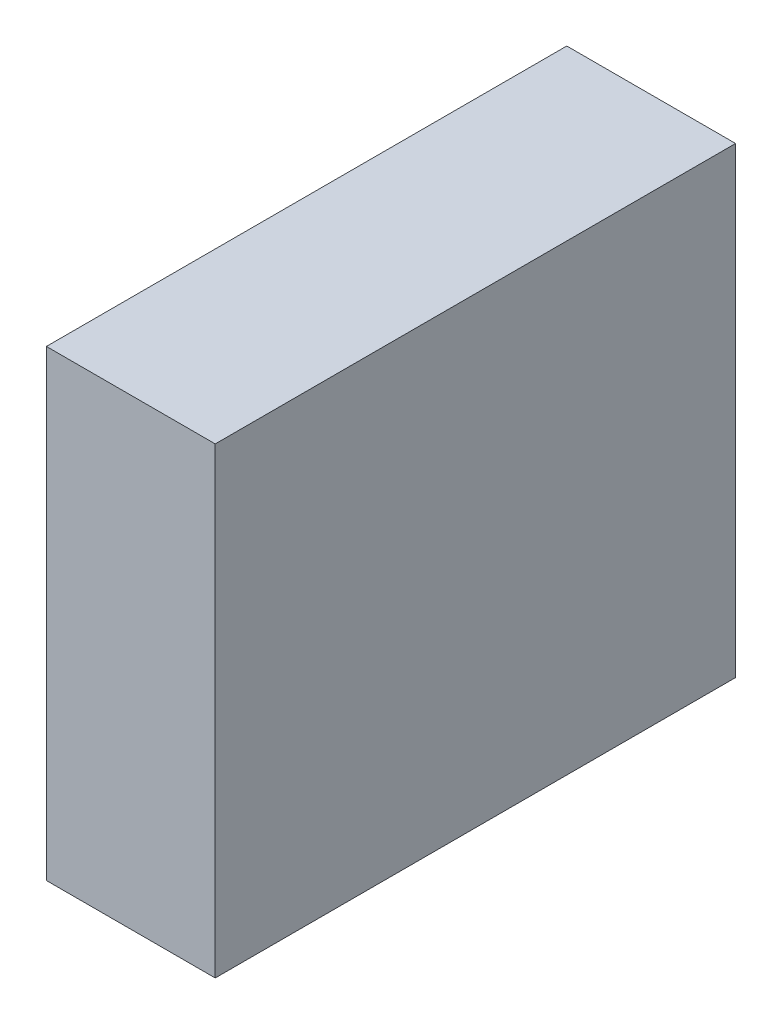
ISO-10303-21;
HEADER;
FILE_DESCRIPTION(('STEP AP214'),'2;1');
FILE_NAME('part.step','',(''),(''),'','','');
FILE_SCHEMA(('AUTOMOTIVE_DESIGN { 1 0 10303 214 1 1 1 1 }'));
ENDSEC;
DATA;
#1=APPLICATION_CONTEXT('core data for automotive mechanical design processes');
#2=APPLICATION_PROTOCOL_DEFINITION('international standard','automotive_design',2000,#1);
#3=PRODUCT_CONTEXT('',#1,'mechanical');
#4=PRODUCT('Part','Part','',(#3));
#5=PRODUCT_RELATED_PRODUCT_CATEGORY('part','',(#4));
#6=PRODUCT_DEFINITION_FORMATION('','',#4);
#7=PRODUCT_DEFINITION_CONTEXT('part definition',#1,'design');
#8=PRODUCT_DEFINITION('design','',#6,#7);
#9=PRODUCT_DEFINITION_SHAPE('','',#8);
#10=(LENGTH_UNIT() NAMED_UNIT(*) SI_UNIT(.MILLI.,.METRE.));
#11=(NAMED_UNIT(*) PLANE_ANGLE_UNIT() SI_UNIT($,.RADIAN.));
#12=(NAMED_UNIT(*) SI_UNIT($,.STERADIAN.) SOLID_ANGLE_UNIT());
#13=UNCERTAINTY_MEASURE_WITH_UNIT(LENGTH_MEASURE(1.E-05),#10,'distance_accuracy_value','');
#14=(GEOMETRIC_REPRESENTATION_CONTEXT(3) GLOBAL_UNCERTAINTY_ASSIGNED_CONTEXT((#13)) GLOBAL_UNIT_ASSIGNED_CONTEXT((#10,
#11,#12)) REPRESENTATION_CONTEXT('',''));
#15=CARTESIAN_POINT('',(0.,0.,0.));
#16=DIRECTION('',(0.,0.,1.));
#17=DIRECTION('',(1.,0.,0.));
#18=AXIS2_PLACEMENT_3D('',#15,#16,#17);
#19=CARTESIAN_POINT('',(1.269999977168E-06,0.,1.79999894));
#20=DIRECTION('',(0.,0.,-1.));
#21=DIRECTION('',(0.,-1.,0.));
#22=AXIS2_PLACEMENT_3D('',#19,#20,#21);
#23=PLANE('',#22);
#24=DIRECTION('',(0.,-1.,0.));
#25=VECTOR('',#24,1.);
#26=CARTESIAN_POINT('',(0.29200094,0.80000094,1.79999894));
#27=LINE('',#26,#25);
#28=CARTESIAN_POINT('',(0.29200094,0.80000094,1.79999894));
#29=VERTEX_POINT('',#28);
#30=CARTESIAN_POINT('',(0.29200094,-0.80000094,1.79999894));
#31=VERTEX_POINT('',#30);
#32=EDGE_CURVE('E26',#29,#31,#27,.T.);
#33=ORIENTED_EDGE('',*,*,#32,.F.);
#34=DIRECTION('',(1.,0.,0.));
#35=VECTOR('',#34,1.);
#36=CARTESIAN_POINT('',(-0.2919984,0.80000094,1.79999894));
#37=LINE('',#36,#35);
#38=CARTESIAN_POINT('',(-0.2919984,0.80000094,1.79999894));
#39=VERTEX_POINT('',#38);
#40=EDGE_CURVE('E111',#39,#29,#37,.T.);
#41=ORIENTED_EDGE('',*,*,#40,.F.);
#42=DIRECTION('',(0.,1.,0.));
#43=VECTOR('',#42,1.);
#44=CARTESIAN_POINT('',(-0.2919984,-0.80000094,1.79999894));
#45=LINE('',#44,#43);
#46=CARTESIAN_POINT('',(-0.2919984,-0.80000094,1.79999894));
#47=VERTEX_POINT('',#46);
#48=EDGE_CURVE('E83',#47,#39,#45,.T.);
#49=ORIENTED_EDGE('',*,*,#48,.F.);
#50=DIRECTION('',(-1.,0.,0.));
#51=VECTOR('',#50,1.);
#52=CARTESIAN_POINT('',(0.29200094,-0.80000094,1.79999894));
#53=LINE('',#52,#51);
#54=EDGE_CURVE('E87',#31,#47,#53,.T.);
#55=ORIENTED_EDGE('',*,*,#54,.F.);
#56=EDGE_LOOP('',(#33,#41,#49,#55));
#57=FACE_BOUND('',#56,.T.);
#58=ADVANCED_FACE('F17',(#57),#23,.F.);
#59=CARTESIAN_POINT('',(1.269999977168E-06,0.,0.));
#60=DIRECTION('',(0.,0.,-1.));
#61=DIRECTION('',(0.,-1.,0.));
#62=AXIS2_PLACEMENT_3D('',#59,#60,#61);
#63=PLANE('',#62);
#64=DIRECTION('',(-1.,0.,0.));
#65=VECTOR('',#64,1.);
#66=CARTESIAN_POINT('',(0.29200094,-0.80000094,0.));
#67=LINE('',#66,#65);
#68=CARTESIAN_POINT('',(0.29200094,-0.80000094,0.));
#69=VERTEX_POINT('',#68);
#70=CARTESIAN_POINT('',(-0.2919984,-0.80000094,0.));
#71=VERTEX_POINT('',#70);
#72=EDGE_CURVE('E71',#69,#71,#67,.T.);
#73=ORIENTED_EDGE('',*,*,#72,.T.);
#74=DIRECTION('',(0.,1.,0.));
#75=VECTOR('',#74,1.);
#76=CARTESIAN_POINT('',(-0.2919984,-0.80000094,0.));
#77=LINE('',#76,#75);
#78=CARTESIAN_POINT('',(-0.2919984,0.80000094,0.));
#79=VERTEX_POINT('',#78);
#80=EDGE_CURVE('E108',#71,#79,#77,.T.);
#81=ORIENTED_EDGE('',*,*,#80,.T.);
#82=DIRECTION('',(1.,0.,0.));
#83=VECTOR('',#82,1.);
#84=CARTESIAN_POINT('',(-0.2919984,0.80000094,0.));
#85=LINE('',#84,#83);
#86=CARTESIAN_POINT('',(0.29200094,0.80000094,0.));
#87=VERTEX_POINT('',#86);
#88=EDGE_CURVE('E73',#79,#87,#85,.T.);
#89=ORIENTED_EDGE('',*,*,#88,.T.);
#90=DIRECTION('',(0.,-1.,0.));
#91=VECTOR('',#90,1.);
#92=CARTESIAN_POINT('',(0.29200094,0.80000094,0.));
#93=LINE('',#92,#91);
#94=EDGE_CURVE('E11',#87,#69,#93,.T.);
#95=ORIENTED_EDGE('',*,*,#94,.T.);
#96=EDGE_LOOP('',(#73,#81,#89,#95));
#97=FACE_BOUND('',#96,.T.);
#98=ADVANCED_FACE('F19',(#97),#63,.T.);
#99=CARTESIAN_POINT('',(0.29200094,0.80000094,0.));
#100=DIRECTION('',(1.,0.,0.));
#101=DIRECTION('',(0.,1.,0.));
#102=AXIS2_PLACEMENT_3D('',#99,#100,#101);
#103=PLANE('',#102);
#104=DIRECTION('',(0.,0.,1.));
#105=VECTOR('',#104,1.);
#106=CARTESIAN_POINT('',(0.29200094,0.80000094,0.));
#107=LINE('',#106,#105);
#108=EDGE_CURVE('E96',#87,#29,#107,.T.);
#109=ORIENTED_EDGE('',*,*,#108,.T.);
#110=ORIENTED_EDGE('',*,*,#32,.T.);
#111=DIRECTION('',(0.,0.,1.));
#112=VECTOR('',#111,1.);
#113=CARTESIAN_POINT('',(0.29200094,-0.80000094,0.));
#114=LINE('',#113,#112);
#115=EDGE_CURVE('E79',#69,#31,#114,.T.);
#116=ORIENTED_EDGE('',*,*,#115,.F.);
#117=ORIENTED_EDGE('',*,*,#94,.F.);
#118=EDGE_LOOP('',(#109,#110,#116,#117));
#119=FACE_BOUND('',#118,.T.);
#120=ADVANCED_FACE('F85',(#119),#103,.T.);
#121=CARTESIAN_POINT('',(-0.2919984,0.80000094,0.));
#122=DIRECTION('',(0.,1.,0.));
#123=DIRECTION('',(1.,0.,0.));
#124=AXIS2_PLACEMENT_3D('',#121,#122,#123);
#125=PLANE('',#124);
#126=DIRECTION('',(0.,0.,1.));
#127=VECTOR('',#126,1.);
#128=CARTESIAN_POINT('',(-0.2919984,0.80000094,0.));
#129=LINE('',#128,#127);
#130=EDGE_CURVE('E104',#79,#39,#129,.T.);
#131=ORIENTED_EDGE('',*,*,#130,.T.);
#132=ORIENTED_EDGE('',*,*,#40,.T.);
#133=ORIENTED_EDGE('',*,*,#108,.F.);
#134=ORIENTED_EDGE('',*,*,#88,.F.);
#135=EDGE_LOOP('',(#131,#132,#133,#134));
#136=FACE_BOUND('',#135,.T.);
#137=ADVANCED_FACE('F121',(#136),#125,.T.);
#138=CARTESIAN_POINT('',(-0.2919984,-0.80000094,0.));
#139=DIRECTION('',(-1.,0.,0.));
#140=DIRECTION('',(0.,0.,1.));
#141=AXIS2_PLACEMENT_3D('',#138,#139,#140);
#142=PLANE('',#141);
#143=DIRECTION('',(0.,0.,1.));
#144=VECTOR('',#143,1.);
#145=CARTESIAN_POINT('',(-0.2919984,-0.80000094,0.));
#146=LINE('',#145,#144);
#147=EDGE_CURVE('E81',#71,#47,#146,.T.);
#148=ORIENTED_EDGE('',*,*,#147,.T.);
#149=ORIENTED_EDGE('',*,*,#48,.T.);
#150=ORIENTED_EDGE('',*,*,#130,.F.);
#151=ORIENTED_EDGE('',*,*,#80,.F.);
#152=EDGE_LOOP('',(#148,#149,#150,#151));
#153=FACE_BOUND('',#152,.T.);
#154=ADVANCED_FACE('F124',(#153),#142,.T.);
#155=CARTESIAN_POINT('',(0.29200094,-0.80000094,0.));
#156=DIRECTION('',(0.,-1.,0.));
#157=DIRECTION('',(0.,0.,-1.));
#158=AXIS2_PLACEMENT_3D('',#155,#156,#157);
#159=PLANE('',#158);
#160=ORIENTED_EDGE('',*,*,#115,.T.);
#161=ORIENTED_EDGE('',*,*,#54,.T.);
#162=ORIENTED_EDGE('',*,*,#147,.F.);
#163=ORIENTED_EDGE('',*,*,#72,.F.);
#164=EDGE_LOOP('',(#160,#161,#162,#163));
#165=FACE_BOUND('',#164,.T.);
#166=ADVANCED_FACE('F77',(#165),#159,.T.);
#167=CLOSED_SHELL('',(#58,#98,#120,#137,#154,#166));
#168=MANIFOLD_SOLID_BREP('B1',#167);
#169=ADVANCED_BREP_SHAPE_REPRESENTATION('',(#18,#168),#14);
#170=SHAPE_DEFINITION_REPRESENTATION(#9,#169);
ENDSEC;
END-ISO-10303-21;
